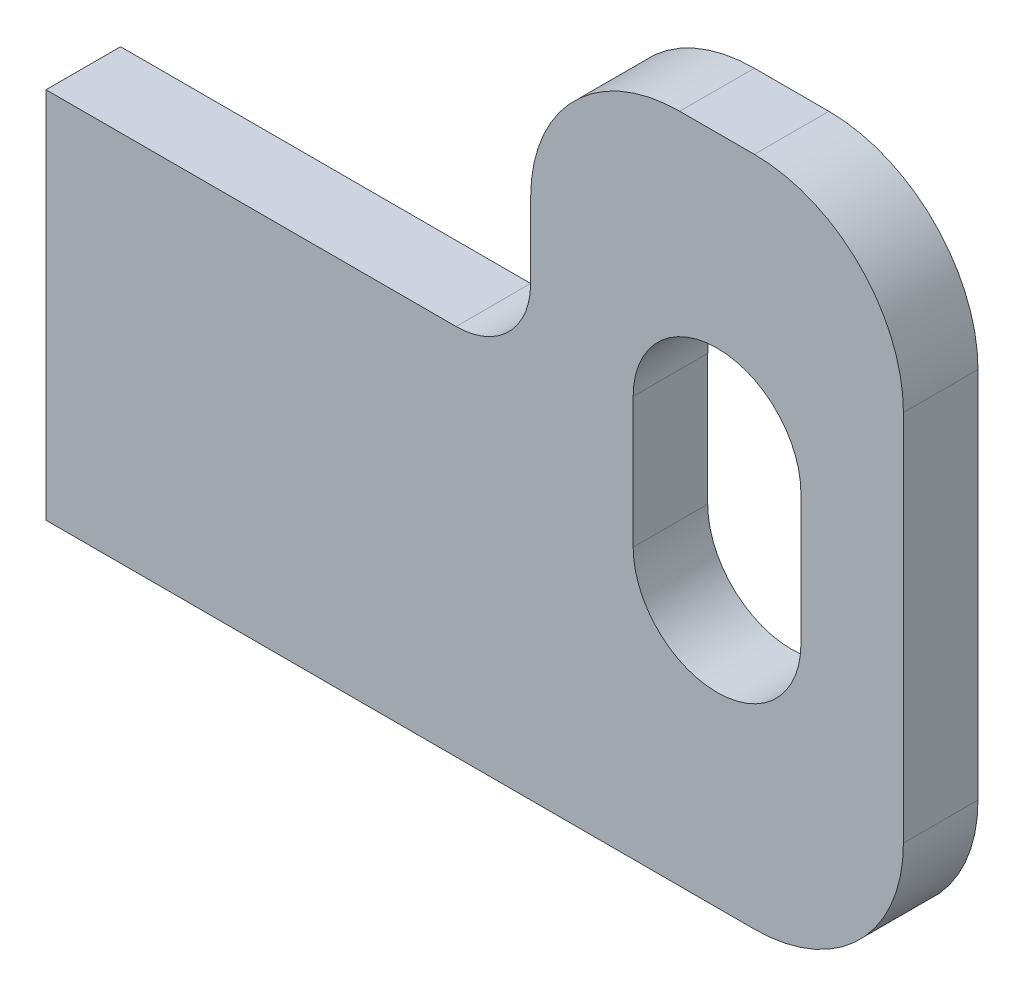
from build123d import *

# Parameters (mm, degrees)
EXTRUDE1_DEPTH = 6.35


with BuildPart() as part:
    # Sketch1 → Extrude1 (new body)
    with BuildSketch(Plane.XY):
        with BuildLine():
            Line((264.741762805, 156.725378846), (229.816762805, 156.725378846))
            Line((229.816762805, 156.725378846), (229.816762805, 124.975378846))
            Line((229.816762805, 124.975378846), (290.141762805, 124.975378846))
            ThreePointArc((290.141762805, 124.975378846), (299.122018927, 128.695122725), (302.841762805, 137.675378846))
            Line((302.841762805, 137.675378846), (302.841762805, 169.425378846))
            ThreePointArc((302.841762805, 169.425378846), (299.122018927, 178.405634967), (290.141762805, 182.125378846))
            Line((290.141762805, 182.125378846), (283.791762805, 182.125378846))
            ThreePointArc((283.791762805, 182.125378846), (274.811506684, 178.405634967), (271.091762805, 169.425378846))
            Line((271.091762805, 169.425378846), (271.091762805, 163.075378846))
            ThreePointArc((271.091762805, 163.075378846), (269.231890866, 158.585250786), (264.741762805, 156.725378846))
        make_face()
        with BuildLine():
            Line((294.111053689, 147.993152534), (294.111053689, 159.105652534))
            ThreePointArc((294.111053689, 159.105652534), (286.967303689, 166.249402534), (279.823553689, 159.105652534))
            Line((279.823553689, 159.105652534), (279.823553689, 147.993152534))
            ThreePointArc((279.823553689, 147.993152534), (286.967303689, 140.849402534), (294.111053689, 147.993152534))
        make_face(mode=Mode.SUBTRACT)
    extrude(amount=EXTRUDE1_DEPTH)


solid = part.part
